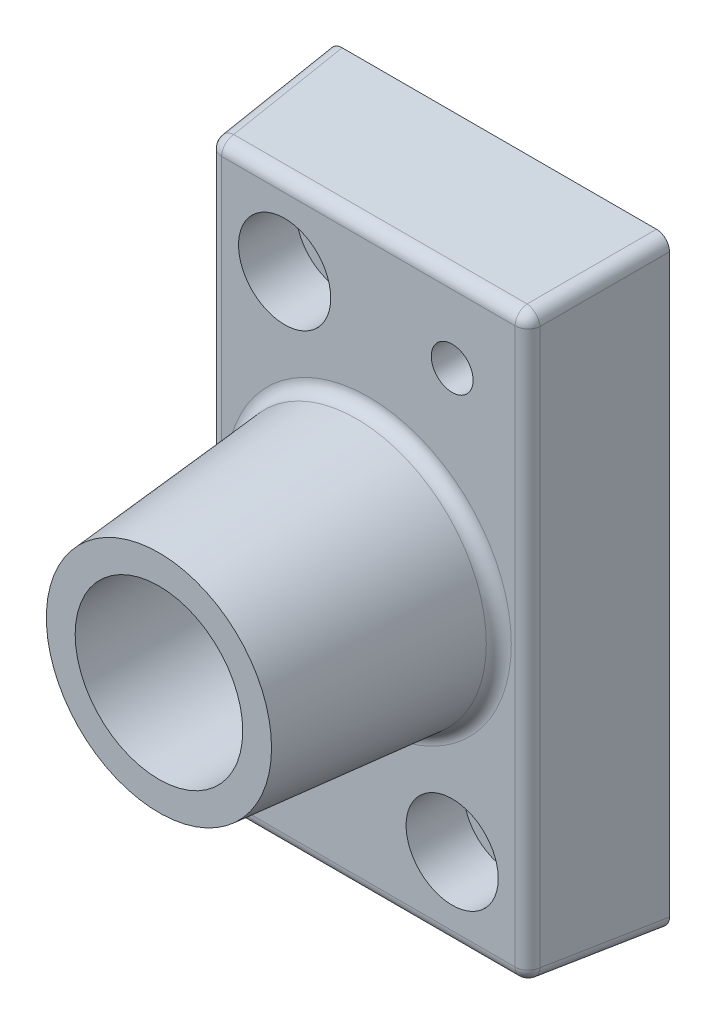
from build123d import *

# Parameters (mm, degrees)
ESQUISSE1_W             = 65
ESQUISSE1_H             = 115
BASE_EXTRUSION_DEPTH    = 25
BASE_EXTRUSION_TAPER    = 5
ESQUISSE2_R             = 25
BOSS_EXTRU_1_DEPTH      = 40
BOSS_EXTRU_1_TAPER      = 5
CONG_1_R                = 2.5
ESQUISSE3_R             = 18
ENL_V_MAT_EXTRU_1_DEPTH = 8.03
ESQUISSE4_R             = 16
ENL_V_MAT_EXTRU_2_DEPTH = 93.668764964
PER_AGE1_D              = 11
PER_AGE1_CBORE_D        = 17.6
PER_AGE1_CBORE_DEPTH    = 11
ESQUISSE7_R             = 4
ENL_V_MAT_EXTRU_3_DEPTH = 78.217226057


with BuildPart() as part:
    # Esquisse1 → Base-Extrusion (new body)
    with BuildSketch(Plane.XY):
        Rectangle(ESQUISSE1_W, ESQUISSE1_H)
    extrude(amount=BASE_EXTRUSION_DEPTH, taper=BASE_EXTRUSION_TAPER)

    # Esquisse2 → Boss.-Extru.1 (add)
    with BuildSketch(Plane.XY.offset(25)):
        Circle(ESQUISSE2_R)
    extrude(amount=BOSS_EXTRU_1_DEPTH, taper=BOSS_EXTRU_1_TAPER)

    # Cong_1
    cong_1_edges = [part.edges().sort_by_distance(p)[0] for p in [
        (-31.406391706, 56.406391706, 12.5),
        (-31.406391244, -56.406391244, 12.50000528),
        (-30.312783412, 0, 25),
        (31.406391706, -56.406391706, 12.5),
        (0, -55.312783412, 25),
        (31.406391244, 56.406391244, 12.50000528),
        (30.312783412, 0, 25),
        (0, 55.312783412, 25),
        (-25, 0, 25),
    ]]
    fillet(cong_1_edges, radius=CONG_1_R)

    # Esquisse3 → Enl_v. mat.-Extru.1 (cut)
    with BuildSketch(Plane(origin=(0, 0, 0), x_dir=(-1, 0, 0), z_dir=(0, 0, -1))):
        Circle(ESQUISSE3_R)
    extrude(amount=-ENL_V_MAT_EXTRU_1_DEPTH, mode=Mode.SUBTRACT)

    # Esquisse4 → Enl_v. mat.-Extru.2 (cut, through all)
    with BuildSketch(Plane.XY.offset(65)):
        Circle(ESQUISSE4_R)
    extrude(amount=-ENL_V_MAT_EXTRU_2_DEPTH, mode=Mode.SUBTRACT)

    # Per_age1 (through all)
    with Locations(Plane.XY.offset(25)):
        with Locations((16, -40), (-16, 40)):
            CounterBoreHole(PER_AGE1_D / 2, PER_AGE1_CBORE_D / 2, PER_AGE1_CBORE_DEPTH)

    # Esquisse7 → Enl_v. mat.-Extru.3 (cut, through all)
    with BuildSketch(Plane.XY.offset(25)):
        with Locations((16, 40)):
            Circle(ESQUISSE7_R)
        with Locations((-16, -40)):
            Circle(ESQUISSE7_R)
    extrude(amount=-ENL_V_MAT_EXTRU_3_DEPTH, mode=Mode.SUBTRACT)


solid = part.part
